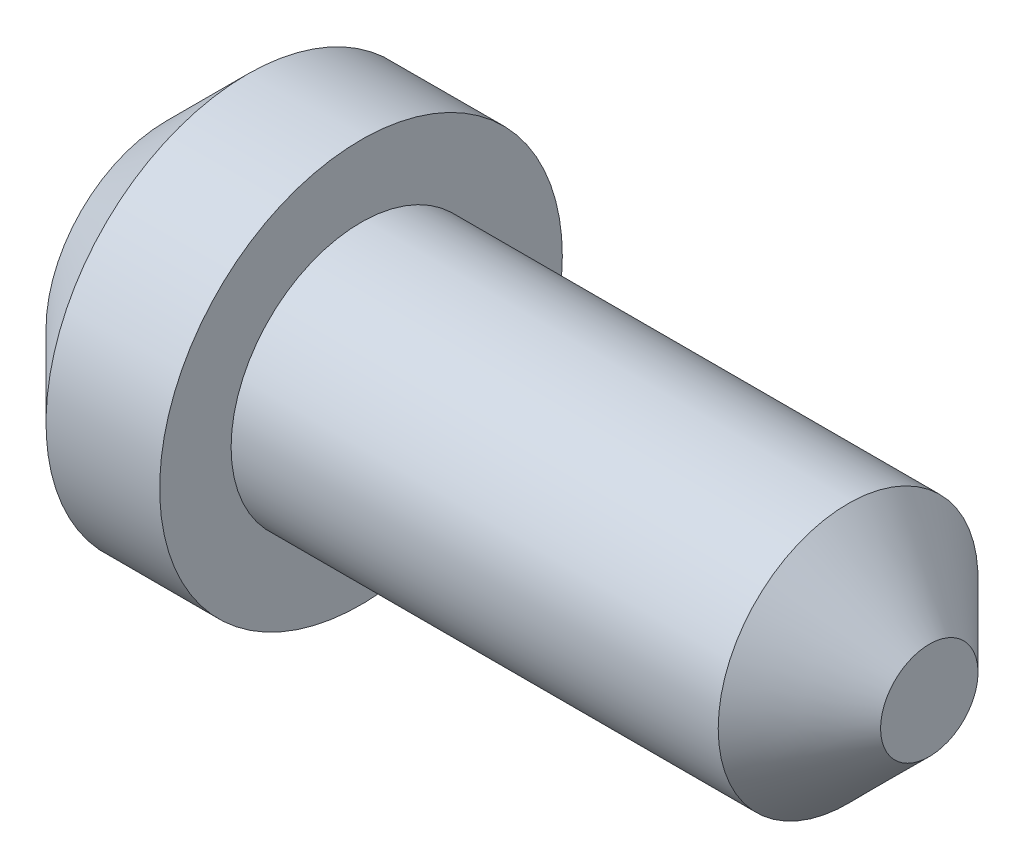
ISO-10303-21;
HEADER;
FILE_DESCRIPTION(('STEP AP214'),'2;1');
FILE_NAME('part.step','',(''),(''),'','','');
FILE_SCHEMA(('AUTOMOTIVE_DESIGN { 1 0 10303 214 1 1 1 1 }'));
ENDSEC;
DATA;
#1=APPLICATION_CONTEXT('core data for automotive mechanical design processes');
#2=APPLICATION_PROTOCOL_DEFINITION('international standard','automotive_design',2000,#1);
#3=PRODUCT_CONTEXT('',#1,'mechanical');
#4=PRODUCT('Part','Part','',(#3));
#5=PRODUCT_RELATED_PRODUCT_CATEGORY('part','',(#4));
#6=PRODUCT_DEFINITION_FORMATION('','',#4);
#7=PRODUCT_DEFINITION_CONTEXT('part definition',#1,'design');
#8=PRODUCT_DEFINITION('design','',#6,#7);
#9=PRODUCT_DEFINITION_SHAPE('','',#8);
#10=(LENGTH_UNIT() NAMED_UNIT(*) SI_UNIT(.MILLI.,.METRE.));
#11=(NAMED_UNIT(*) PLANE_ANGLE_UNIT() SI_UNIT($,.RADIAN.));
#12=(NAMED_UNIT(*) SI_UNIT($,.STERADIAN.) SOLID_ANGLE_UNIT());
#13=UNCERTAINTY_MEASURE_WITH_UNIT(LENGTH_MEASURE(1.E-05),#10,'distance_accuracy_value','');
#14=(GEOMETRIC_REPRESENTATION_CONTEXT(3) GLOBAL_UNCERTAINTY_ASSIGNED_CONTEXT((#13)) GLOBAL_UNIT_ASSIGNED_CONTEXT((#10,
#11,#12)) REPRESENTATION_CONTEXT('',''));
#15=CARTESIAN_POINT('',(0.,0.,0.));
#16=DIRECTION('',(0.,0.,1.));
#17=DIRECTION('',(1.,0.,0.));
#18=AXIS2_PLACEMENT_3D('',#15,#16,#17);
#19=CARTESIAN_POINT('',(0.,0.,0.));
#20=DIRECTION('',(1.,0.,0.));
#21=DIRECTION('',(0.,0.,-1.));
#22=AXIS2_PLACEMENT_3D('',#19,#20,#21);
#23=PLANE('',#22);
#24=CARTESIAN_POINT('',(0.,0.,0.));
#25=DIRECTION('',(1.,0.,0.));
#26=DIRECTION('',(0.,1.,0.));
#27=AXIS2_PLACEMENT_3D('',#24,#25,#26);
#28=CIRCLE('',#27,2.5061333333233);
#29=CARTESIAN_POINT('',(0.,2.5061333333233,0.));
#30=VERTEX_POINT('',#29);
#31=EDGE_CURVE('E17',#30,#30,#28,.T.);
#32=ORIENTED_EDGE('',*,*,#31,.F.);
#33=EDGE_LOOP('',(#32));
#34=FACE_BOUND('',#33,.T.);
#35=ADVANCED_FACE('F14',(#34),#23,.F.);
#36=CARTESIAN_POINT('',(1.69333333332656,0.,0.));
#37=DIRECTION('',(1.,0.,0.));
#38=DIRECTION('',(0.,1.,0.));
#39=AXIS2_PLACEMENT_3D('',#36,#37,#38);
#40=CONICAL_SURFACE('',#39,4.19946666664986,0.785398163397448);
#41=CARTESIAN_POINT('',(1.69333333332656,0.,0.));
#42=DIRECTION('',(1.,0.,0.));
#43=DIRECTION('',(0.,0.,-1.));
#44=AXIS2_PLACEMENT_3D('',#41,#42,#43);
#45=CIRCLE('',#44,4.19946666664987);
#46=CARTESIAN_POINT('',(1.69333333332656,0.,-4.19946666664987));
#47=VERTEX_POINT('',#46);
#48=EDGE_CURVE('E30',#47,#47,#45,.T.);
#49=ORIENTED_EDGE('',*,*,#48,.F.);
#50=EDGE_LOOP('',(#49));
#51=FACE_BOUND('',#50,.T.);
#52=ORIENTED_EDGE('',*,*,#31,.T.);
#53=EDGE_LOOP('',(#52));
#54=FACE_BOUND('',#53,.T.);
#55=ADVANCED_FACE('F42',(#51,#54),#40,.T.);
#56=CARTESIAN_POINT('',(15.9173333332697,0.,0.));
#57=DIRECTION('',(-1.,0.,0.));
#58=DIRECTION('',(0.,0.,1.));
#59=AXIS2_PLACEMENT_3D('',#56,#57,#58);
#60=PLANE('',#59);
#61=CARTESIAN_POINT('',(15.9173333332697,0.,0.));
#62=DIRECTION('',(-1.,0.,0.));
#63=DIRECTION('',(0.,0.,1.));
#64=AXIS2_PLACEMENT_3D('',#61,#62,#63);
#65=CIRCLE('',#64,1.01599999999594);
#66=CARTESIAN_POINT('',(15.9173333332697,0.,1.01599999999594));
#67=VERTEX_POINT('',#66);
#68=EDGE_CURVE('E32',#67,#67,#65,.T.);
#69=ORIENTED_EDGE('',*,*,#68,.F.);
#70=EDGE_LOOP('',(#69));
#71=FACE_BOUND('',#70,.T.);
#72=ADVANCED_FACE('F49',(#71),#60,.F.);
#73=CARTESIAN_POINT('',(0.,0.,0.));
#74=DIRECTION('',(1.,0.,0.));
#75=DIRECTION('',(0.,0.,-1.));
#76=AXIS2_PLACEMENT_3D('',#73,#74,#75);
#77=CYLINDRICAL_SURFACE('',#76,4.19946666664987);
#78=CARTESIAN_POINT('',(4.06399999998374,0.,0.));
#79=DIRECTION('',(1.,0.,0.));
#80=DIRECTION('',(0.,0.,-1.));
#81=AXIS2_PLACEMENT_3D('',#78,#79,#80);
#82=CIRCLE('',#81,4.19946666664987);
#83=CARTESIAN_POINT('',(4.06399999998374,0.,-4.19946666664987));
#84=VERTEX_POINT('',#83);
#85=EDGE_CURVE('E26',#84,#84,#82,.T.);
#86=ORIENTED_EDGE('',*,*,#85,.F.);
#87=EDGE_LOOP('',(#86));
#88=FACE_BOUND('',#87,.T.);
#89=ORIENTED_EDGE('',*,*,#48,.T.);
#90=EDGE_LOOP('',(#89));
#91=FACE_BOUND('',#90,.T.);
#92=ADVANCED_FACE('F65',(#88,#91),#77,.T.);
#93=CARTESIAN_POINT('',(14.2239999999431,0.,0.));
#94=DIRECTION('',(-1.,0.,0.));
#95=DIRECTION('',(0.,0.,1.));
#96=AXIS2_PLACEMENT_3D('',#93,#94,#95);
#97=CONICAL_SURFACE('',#96,2.7093333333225,0.785398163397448);
#98=ORIENTED_EDGE('',*,*,#68,.T.);
#99=EDGE_LOOP('',(#98));
#100=FACE_BOUND('',#99,.T.);
#101=CARTESIAN_POINT('',(14.2239999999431,0.,0.));
#102=DIRECTION('',(-1.,0.,0.));
#103=DIRECTION('',(0.,0.,1.));
#104=AXIS2_PLACEMENT_3D('',#101,#102,#103);
#105=CIRCLE('',#104,2.7093333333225);
#106=CARTESIAN_POINT('',(14.2239999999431,0.,2.7093333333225));
#107=VERTEX_POINT('',#106);
#108=EDGE_CURVE('E21',#107,#107,#105,.T.);
#109=ORIENTED_EDGE('',*,*,#108,.F.);
#110=EDGE_LOOP('',(#109));
#111=FACE_BOUND('',#110,.T.);
#112=ADVANCED_FACE('F59',(#100,#111),#97,.T.);
#113=CARTESIAN_POINT('',(4.06399999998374,0.,0.));
#114=DIRECTION('',(1.,0.,0.));
#115=DIRECTION('',(0.,0.,-1.));
#116=AXIS2_PLACEMENT_3D('',#113,#114,#115);
#117=PLANE('',#116);
#118=CARTESIAN_POINT('',(4.06399999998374,0.,0.));
#119=DIRECTION('',(-1.,0.,0.));
#120=DIRECTION('',(0.,0.,1.));
#121=AXIS2_PLACEMENT_3D('',#118,#119,#120);
#122=CIRCLE('',#121,2.7093333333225);
#123=CARTESIAN_POINT('',(4.06399999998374,0.,2.7093333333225));
#124=VERTEX_POINT('',#123);
#125=EDGE_CURVE('E10',#124,#124,#122,.F.);
#126=ORIENTED_EDGE('',*,*,#125,.F.);
#127=EDGE_LOOP('',(#126));
#128=FACE_BOUND('',#127,.T.);
#129=ORIENTED_EDGE('',*,*,#85,.T.);
#130=EDGE_LOOP('',(#129));
#131=FACE_BOUND('',#130,.T.);
#132=ADVANCED_FACE('F53',(#128,#131),#117,.T.);
#133=CARTESIAN_POINT('',(16.509999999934,0.,0.));
#134=DIRECTION('',(-1.,0.,0.));
#135=DIRECTION('',(0.,0.,1.));
#136=AXIS2_PLACEMENT_3D('',#133,#134,#135);
#137=CYLINDRICAL_SURFACE('',#136,2.7093333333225);
#138=ORIENTED_EDGE('',*,*,#108,.T.);
#139=EDGE_LOOP('',(#138));
#140=FACE_BOUND('',#139,.T.);
#141=ORIENTED_EDGE('',*,*,#125,.T.);
#142=EDGE_LOOP('',(#141));
#143=FACE_BOUND('',#142,.T.);
#144=ADVANCED_FACE('F51',(#140,#143),#137,.T.);
#145=CLOSED_SHELL('',(#35,#55,#72,#92,#112,#132,#144));
#146=MANIFOLD_SOLID_BREP('B1',#145);
#147=ADVANCED_BREP_SHAPE_REPRESENTATION('',(#18,#146),#14);
#148=SHAPE_DEFINITION_REPRESENTATION(#9,#147);
ENDSEC;
END-ISO-10303-21;
